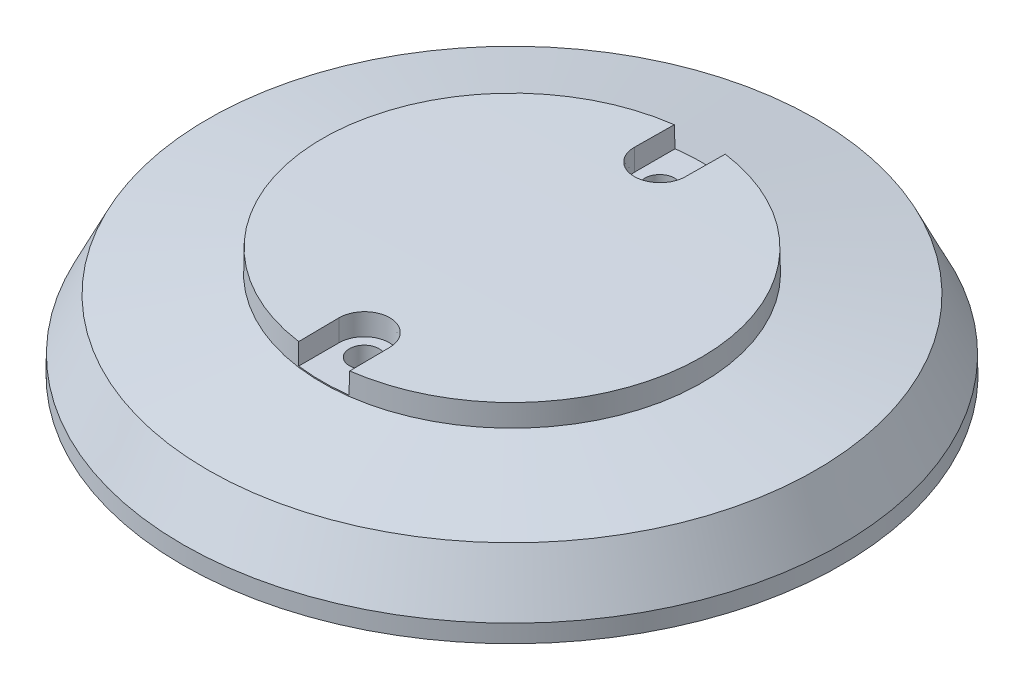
ISO-10303-21;
HEADER;
FILE_DESCRIPTION(('STEP AP214'),'2;1');
FILE_NAME('part.step','',(''),(''),'','','');
FILE_SCHEMA(('AUTOMOTIVE_DESIGN { 1 0 10303 214 1 1 1 1 }'));
ENDSEC;
DATA;
#1=APPLICATION_CONTEXT('core data for automotive mechanical design processes');
#2=APPLICATION_PROTOCOL_DEFINITION('international standard','automotive_design',2000,#1);
#3=PRODUCT_CONTEXT('',#1,'mechanical');
#4=PRODUCT('Part','Part','',(#3));
#5=PRODUCT_RELATED_PRODUCT_CATEGORY('part','',(#4));
#6=PRODUCT_DEFINITION_FORMATION('','',#4);
#7=PRODUCT_DEFINITION_CONTEXT('part definition',#1,'design');
#8=PRODUCT_DEFINITION('design','',#6,#7);
#9=PRODUCT_DEFINITION_SHAPE('','',#8);
#10=(LENGTH_UNIT() NAMED_UNIT(*) SI_UNIT(.MILLI.,.METRE.));
#11=(NAMED_UNIT(*) PLANE_ANGLE_UNIT() SI_UNIT($,.RADIAN.));
#12=(NAMED_UNIT(*) SI_UNIT($,.STERADIAN.) SOLID_ANGLE_UNIT());
#13=UNCERTAINTY_MEASURE_WITH_UNIT(LENGTH_MEASURE(1.E-05),#10,'distance_accuracy_value','');
#14=(GEOMETRIC_REPRESENTATION_CONTEXT(3) GLOBAL_UNCERTAINTY_ASSIGNED_CONTEXT((#13)) GLOBAL_UNIT_ASSIGNED_CONTEXT((#10,
#11,#12)) REPRESENTATION_CONTEXT('',''));
#15=CARTESIAN_POINT('',(0.,0.,0.));
#16=DIRECTION('',(0.,0.,1.));
#17=DIRECTION('',(1.,0.,0.));
#18=AXIS2_PLACEMENT_3D('',#15,#16,#17);
#19=CARTESIAN_POINT('',(0.,11.0489999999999,0.));
#20=DIRECTION('',(0.,-1.,0.));
#21=DIRECTION('',(0.,0.,-1.));
#22=AXIS2_PLACEMENT_3D('',#19,#20,#21);
#23=CONICAL_SURFACE('',#22,18.3797766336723,0.0174532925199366);
#24=CARTESIAN_POINT('',(-1.1459821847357,10.32149,-18.3567392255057));
#25=CARTESIAN_POINT('',(-1.13403179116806,9.7502145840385,-18.3674761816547));
#26=CARTESIAN_POINT('',(-1.1217388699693,9.17894639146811,-18.3782217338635));
#27=CARTESIAN_POINT('',(-1.09638391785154,8.03642874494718,-18.3997299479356));
#28=CARTESIAN_POINT('',(-1.08332188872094,7.46517929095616,-18.4104926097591));
#29=CARTESIAN_POINT('',(-1.05606071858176,6.31067798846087,-18.4322617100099));
#30=CARTESIAN_POINT('',(-1.04184343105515,5.72742657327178,-18.4432685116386));
#31=CARTESIAN_POINT('',(-1.01239495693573,4.56094832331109,-18.4652998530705));
#32=CARTESIAN_POINT('',(-0.997163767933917,3.97772148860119,-18.4763243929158));
#33=CARTESIAN_POINT('',(-0.981363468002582,3.39450999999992,-18.4873577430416));
#34=B_SPLINE_CURVE_WITH_KNOTS('',3,(#24,#25,#26,#27,#28,#29,#30,#31,#32,#33),.UNSPECIFIED.,.F.,
.F.,(4,2,2,2,4),(0.,1.71450383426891,3.429003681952,5.17958829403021,6.93017706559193),.UNSPECIFIED.);
#35=CARTESIAN_POINT('',(-1.08088361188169,7.36599999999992,-18.4123647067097));
#36=VERTEX_POINT('',#35);
#37=CARTESIAN_POINT('',(-0.982297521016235,3.42899999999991,-18.4867052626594));
#38=VERTEX_POINT('',#37);
#39=EDGE_CURVE('E178',#36,#38,#34,.T.);
#40=ORIENTED_EDGE('',*,*,#39,.F.);
#41=CARTESIAN_POINT('',(0.,7.36599999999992,0.));
#42=DIRECTION('',(0.,-1.,0.));
#43=DIRECTION('',(0.,0.,-1.));
#44=AXIS2_PLACEMENT_3D('',#41,#42,#43);
#45=CIRCLE('',#44,18.4440636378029);
#46=CARTESIAN_POINT('',(-4.44421299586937,7.36599999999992,-17.9006272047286));
#47=VERTEX_POINT('',#46);
#48=EDGE_CURVE('E189',#47,#36,#45,.T.);
#49=ORIENTED_EDGE('',*,*,#48,.F.);
#50=CARTESIAN_POINT('',(-4.44420950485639,7.36579999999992,-17.9006316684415));
#51=CARTESIAN_POINT('',(-4.45492518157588,7.97970070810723,-17.8869303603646));
#52=CARTESIAN_POINT('',(-4.46564085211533,8.59360106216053,-17.8732132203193));
#53=CARTESIAN_POINT('',(-4.4870721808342,9.82140106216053,-17.8457472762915));
#54=CARTESIAN_POINT('',(-4.49778783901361,10.4353007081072,-17.8319984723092));
#55=CARTESIAN_POINT('',(-4.50850349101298,11.0491999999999,-17.8182338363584));
#56=B_SPLINE_CURVE_WITH_KNOTS('',3,(#50,#51,#52,#53,#54,#55),.UNSPECIFIED.,.F.,.F.,(4,2,4),(0.,
1.84244122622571,3.68488245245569),.UNSPECIFIED.);
#57=CARTESIAN_POINT('',(-4.5085,11.0489999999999,-17.818238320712));
#58=VERTEX_POINT('',#57);
#59=EDGE_CURVE('E310',#47,#58,#56,.T.);
#60=ORIENTED_EDGE('',*,*,#59,.T.);
#61=CARTESIAN_POINT('',(0.,11.0489999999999,0.));
#62=DIRECTION('',(0.,-1.,0.));
#63=DIRECTION('',(0.,0.,-1.));
#64=AXIS2_PLACEMENT_3D('',#61,#62,#63);
#65=CIRCLE('',#64,18.3797766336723);
#66=CARTESIAN_POINT('',(-4.5085,11.0489999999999,17.818238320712));
#67=VERTEX_POINT('',#66);
#68=EDGE_CURVE('E439',#67,#58,#65,.T.);
#69=ORIENTED_EDGE('',*,*,#68,.F.);
#70=CARTESIAN_POINT('',(-4.44420950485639,7.36579999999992,17.9006316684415));
#71=CARTESIAN_POINT('',(-4.45492518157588,7.97970070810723,17.8869303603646));
#72=CARTESIAN_POINT('',(-4.46564085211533,8.59360106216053,17.8732132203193));
#73=CARTESIAN_POINT('',(-4.4870721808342,9.82140106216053,17.8457472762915));
#74=CARTESIAN_POINT('',(-4.49778783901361,10.4353007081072,17.8319984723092));
#75=CARTESIAN_POINT('',(-4.50850349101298,11.0491999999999,17.8182338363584));
#76=B_SPLINE_CURVE_WITH_KNOTS('',3,(#70,#71,#72,#73,#74,#75),.UNSPECIFIED.,.F.,.F.,(4,2,4),(0.,
1.84244122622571,3.68488245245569),.UNSPECIFIED.);
#77=CARTESIAN_POINT('',(-4.44421299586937,7.36599999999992,17.9006272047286));
#78=VERTEX_POINT('',#77);
#79=EDGE_CURVE('E317',#78,#67,#76,.T.);
#80=ORIENTED_EDGE('',*,*,#79,.F.);
#81=CARTESIAN_POINT('',(0.,7.36599999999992,0.));
#82=DIRECTION('',(0.,-1.,0.));
#83=DIRECTION('',(0.,0.,-1.));
#84=AXIS2_PLACEMENT_3D('',#81,#82,#83);
#85=CIRCLE('',#84,18.4440636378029);
#86=CARTESIAN_POINT('',(-1.08088361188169,7.36599999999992,18.4123647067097));
#87=VERTEX_POINT('',#86);
#88=EDGE_CURVE('E202',#87,#78,#85,.T.);
#89=ORIENTED_EDGE('',*,*,#88,.F.);
#90=CARTESIAN_POINT('',(-0.981363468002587,3.39450999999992,18.4873577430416));
#91=CARTESIAN_POINT('',(-0.996838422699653,3.96570022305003,18.4765518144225));
#92=CARTESIAN_POINT('',(-1.01176704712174,4.53690518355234,18.4657543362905));
#93=CARTESIAN_POINT('',(-1.04064922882,5.67933877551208,18.4441763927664));
#94=CARTESIAN_POINT('',(-1.05460278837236,6.25056740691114,18.4333959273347));
#95=CARTESIAN_POINT('',(-1.0819371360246,7.40506694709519,18.4116253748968));
#96=CARTESIAN_POINT('',(-1.09529969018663,7.98833829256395,18.4006356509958));
#97=CARTESIAN_POINT('',(-1.12122114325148,9.154900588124,18.3786740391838));
#98=CARTESIAN_POINT('',(-1.13378004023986,9.73819153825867,18.3677021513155));
#99=CARTESIAN_POINT('',(-1.1459821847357,10.32149,18.3567392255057));
#100=B_SPLINE_CURVE_WITH_KNOTS('',3,(#90,#91,#92,#93,#94,#95,#96,#97,#98,#99),.UNSPECIFIED.,.F.,
.F.,(4,2,2,2,4),(0.,1.71450535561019,3.42900670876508,5.17958980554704,6.93017707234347),.UNSPECIFIED.);
#101=CARTESIAN_POINT('',(-0.982297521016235,3.42899999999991,18.4867052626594));
#102=VERTEX_POINT('',#101);
#103=EDGE_CURVE('E64',#102,#87,#100,.T.);
#104=ORIENTED_EDGE('',*,*,#103,.F.);
#105=CARTESIAN_POINT('',(0.,3.42899999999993,0.));
#106=DIRECTION('',(0.,-1.,0.));
#107=DIRECTION('',(0.,0.,-1.));
#108=AXIS2_PLACEMENT_3D('',#105,#106,#107);
#109=CIRCLE('',#108,18.5127842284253);
#110=EDGE_CURVE('E191',#102,#38,#109,.T.);
#111=ORIENTED_EDGE('',*,*,#110,.T.);
#112=EDGE_LOOP('',(#40,#49,#60,#69,#80,#89,#104,#111));
#113=FACE_BOUND('',#112,.T.);
#114=ADVANCED_FACE('F36',(#113),#23,.F.);
#115=CARTESIAN_POINT('',(0.981363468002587,3.39450999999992,-18.4873577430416));
#116=CARTESIAN_POINT('',(0.996838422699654,3.96570022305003,-18.4765518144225));
#117=CARTESIAN_POINT('',(1.01176704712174,4.53690518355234,-18.4657543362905));
#118=CARTESIAN_POINT('',(1.04064922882,5.67933877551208,-18.4441763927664));
#119=CARTESIAN_POINT('',(1.05460278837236,6.25056740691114,-18.4333959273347));
#120=CARTESIAN_POINT('',(1.0819371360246,7.40506694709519,-18.4116253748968));
#121=CARTESIAN_POINT('',(1.09529969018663,7.98833829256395,-18.4006356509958));
#122=CARTESIAN_POINT('',(1.12122114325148,9.154900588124,-18.3786740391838));
#123=CARTESIAN_POINT('',(1.13378004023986,9.73819153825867,-18.3677021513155));
#124=CARTESIAN_POINT('',(1.1459821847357,10.32149,-18.3567392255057));
#125=B_SPLINE_CURVE_WITH_KNOTS('',3,(#115,#116,#117,#118,#119,#120,#121,#122,#123,#124),
.UNSPECIFIED.,.F.,.F.,(4,2,2,2,4),(0.,1.71450535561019,3.42900670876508,5.17958980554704,
6.93017707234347),.UNSPECIFIED.);
#126=CARTESIAN_POINT('',(0.982297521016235,3.42899999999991,-18.4867052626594));
#127=VERTEX_POINT('',#126);
#128=CARTESIAN_POINT('',(1.08088361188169,7.36599999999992,-18.4123647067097));
#129=VERTEX_POINT('',#128);
#130=EDGE_CURVE('E56',#127,#129,#125,.T.);
#131=ORIENTED_EDGE('',*,*,#130,.F.);
#132=CARTESIAN_POINT('',(0.982297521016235,3.42899999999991,18.4867052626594));
#133=VERTEX_POINT('',#132);
#134=EDGE_CURVE('E514',#127,#133,#109,.T.);
#135=ORIENTED_EDGE('',*,*,#134,.T.);
#136=CARTESIAN_POINT('',(1.1459821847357,10.32149,18.3567392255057));
#137=CARTESIAN_POINT('',(1.13403179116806,9.7502145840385,18.3674761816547));
#138=CARTESIAN_POINT('',(1.1217388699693,9.17894639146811,18.3782217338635));
#139=CARTESIAN_POINT('',(1.09638391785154,8.03642874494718,18.3997299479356));
#140=CARTESIAN_POINT('',(1.08332188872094,7.46517929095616,18.4104926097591));
#141=CARTESIAN_POINT('',(1.05606071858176,6.31067798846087,18.4322617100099));
#142=CARTESIAN_POINT('',(1.04184343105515,5.72742657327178,18.4432685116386));
#143=CARTESIAN_POINT('',(1.01239495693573,4.56094832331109,18.4652998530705));
#144=CARTESIAN_POINT('',(0.997163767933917,3.97772148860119,18.4763243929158));
#145=CARTESIAN_POINT('',(0.981363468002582,3.39450999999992,18.4873577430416));
#146=B_SPLINE_CURVE_WITH_KNOTS('',3,(#136,#137,#138,#139,#140,#141,#142,#143,#144,#145),
.UNSPECIFIED.,.F.,.F.,(4,2,2,2,4),(0.,1.71450383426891,3.429003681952,5.17958829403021,
6.93017706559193),.UNSPECIFIED.);
#147=CARTESIAN_POINT('',(1.08088361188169,7.36599999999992,18.4123647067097));
#148=VERTEX_POINT('',#147);
#149=EDGE_CURVE('E339',#148,#133,#146,.T.);
#150=ORIENTED_EDGE('',*,*,#149,.F.);
#151=CARTESIAN_POINT('',(4.44421299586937,7.36599999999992,17.9006272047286));
#152=VERTEX_POINT('',#151);
#153=EDGE_CURVE('E208',#152,#148,#85,.T.);
#154=ORIENTED_EDGE('',*,*,#153,.F.);
#155=CARTESIAN_POINT('',(4.50850349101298,11.0491999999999,17.8182338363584));
#156=CARTESIAN_POINT('',(4.49778783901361,10.4353007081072,17.8319984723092));
#157=CARTESIAN_POINT('',(4.4870721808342,9.82140106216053,17.8457472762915));
#158=CARTESIAN_POINT('',(4.46564085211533,8.59360106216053,17.8732132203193));
#159=CARTESIAN_POINT('',(4.45492518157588,7.97970070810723,17.8869303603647));
#160=CARTESIAN_POINT('',(4.44420950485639,7.36579999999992,17.9006316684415));
#161=B_SPLINE_CURVE_WITH_KNOTS('',3,(#155,#156,#157,#158,#159,#160),.UNSPECIFIED.,.F.,.F.,(4,2,
4),(0.,1.84244122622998,3.68488245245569),.UNSPECIFIED.);
#162=CARTESIAN_POINT('',(4.5085,11.0489999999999,17.818238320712));
#163=VERTEX_POINT('',#162);
#164=EDGE_CURVE('E325',#163,#152,#161,.T.);
#165=ORIENTED_EDGE('',*,*,#164,.F.);
#166=CARTESIAN_POINT('',(4.5085,11.0489999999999,-17.818238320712));
#167=VERTEX_POINT('',#166);
#168=EDGE_CURVE('E470',#167,#163,#65,.T.);
#169=ORIENTED_EDGE('',*,*,#168,.F.);
#170=CARTESIAN_POINT('',(4.50850349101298,11.0491999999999,-17.8182338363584));
#171=CARTESIAN_POINT('',(4.49778783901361,10.4353007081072,-17.8319984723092));
#172=CARTESIAN_POINT('',(4.4870721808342,9.82140106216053,-17.8457472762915));
#173=CARTESIAN_POINT('',(4.46564085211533,8.59360106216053,-17.8732132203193));
#174=CARTESIAN_POINT('',(4.45492518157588,7.97970070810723,-17.8869303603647));
#175=CARTESIAN_POINT('',(4.44420950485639,7.36579999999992,-17.9006316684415));
#176=B_SPLINE_CURVE_WITH_KNOTS('',3,(#170,#171,#172,#173,#174,#175),.UNSPECIFIED.,.F.,.F.,(4,2,
4),(0.,1.84244122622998,3.68488245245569),.UNSPECIFIED.);
#177=CARTESIAN_POINT('',(4.44421299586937,7.36599999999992,-17.9006272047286));
#178=VERTEX_POINT('',#177);
#179=EDGE_CURVE('E301',#167,#178,#176,.T.);
#180=ORIENTED_EDGE('',*,*,#179,.T.);
#181=EDGE_CURVE('E199',#129,#178,#45,.T.);
#182=ORIENTED_EDGE('',*,*,#181,.F.);
#183=EDGE_LOOP('',(#131,#135,#150,#154,#165,#169,#180,#182));
#184=FACE_BOUND('',#183,.T.);
#185=ADVANCED_FACE('F285',(#184),#23,.F.);
#186=CARTESIAN_POINT('',(18.3797766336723,11.0489999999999,0.));
#187=DIRECTION('',(0.,-1.,0.));
#188=DIRECTION('',(0.,0.,-1.));
#189=AXIS2_PLACEMENT_3D('',#186,#187,#188);
#190=PLANE('',#189);
#191=DIRECTION('',(0.,0.,1.));
#192=VECTOR('',#191,1.);
#193=CARTESIAN_POINT('',(4.5085,11.0489999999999,0.));
#194=LINE('',#193,#192);
#195=CARTESIAN_POINT('',(4.5085,11.0489999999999,17.0815));
#196=VERTEX_POINT('',#195);
#197=EDGE_CURVE('E198',#196,#163,#194,.T.);
#198=ORIENTED_EDGE('',*,*,#197,.F.);
#199=CARTESIAN_POINT('',(0.,11.0489999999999,17.0815));
#200=DIRECTION('',(0.,1.,0.));
#201=DIRECTION('',(0.,0.,1.));
#202=AXIS2_PLACEMENT_3D('',#199,#200,#201);
#203=CIRCLE('',#202,4.5085);
#204=CARTESIAN_POINT('',(-4.5085,11.0489999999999,17.0815));
#205=VERTEX_POINT('',#204);
#206=EDGE_CURVE('E411',#196,#205,#203,.T.);
#207=ORIENTED_EDGE('',*,*,#206,.T.);
#208=DIRECTION('',(0.,0.,1.));
#209=VECTOR('',#208,1.);
#210=CARTESIAN_POINT('',(-4.5085,11.0489999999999,17.0815));
#211=LINE('',#210,#209);
#212=EDGE_CURVE('E413',#205,#67,#211,.T.);
#213=ORIENTED_EDGE('',*,*,#212,.T.);
#214=ORIENTED_EDGE('',*,*,#68,.T.);
#215=DIRECTION('',(0.,0.,-1.));
#216=VECTOR('',#215,1.);
#217=CARTESIAN_POINT('',(-4.5085,11.0489999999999,-17.0815));
#218=LINE('',#217,#216);
#219=CARTESIAN_POINT('',(-4.5085,11.0489999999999,-17.0815));
#220=VERTEX_POINT('',#219);
#221=EDGE_CURVE('E444',#220,#58,#218,.T.);
#222=ORIENTED_EDGE('',*,*,#221,.F.);
#223=CARTESIAN_POINT('',(0.,11.0489999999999,-17.0815));
#224=DIRECTION('',(0.,-1.,0.));
#225=DIRECTION('',(0.,0.,-1.));
#226=AXIS2_PLACEMENT_3D('',#223,#224,#225);
#227=CIRCLE('',#226,4.5085);
#228=CARTESIAN_POINT('',(4.5085,11.0489999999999,-17.0815));
#229=VERTEX_POINT('',#228);
#230=EDGE_CURVE('E441',#229,#220,#227,.T.);
#231=ORIENTED_EDGE('',*,*,#230,.F.);
#232=DIRECTION('',(0.,0.,1.));
#233=VECTOR('',#232,1.);
#234=CARTESIAN_POINT('',(4.5085,11.0489999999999,0.));
#235=LINE('',#234,#233);
#236=EDGE_CURVE('E204',#229,#167,#235,.F.);
#237=ORIENTED_EDGE('',*,*,#236,.T.);
#238=ORIENTED_EDGE('',*,*,#168,.T.);
#239=EDGE_LOOP('',(#198,#207,#213,#214,#222,#231,#237,#238));
#240=FACE_BOUND('',#239,.T.);
#241=ADVANCED_FACE('F290',(#240),#190,.T.);
#242=CARTESIAN_POINT('',(0.,-1876.75837499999,0.));
#243=DIRECTION('',(0.,-1.,0.));
#244=DIRECTION('',(1.,0.,0.));
#245=AXIS2_PLACEMENT_3D('',#242,#243,#244);
#246=SPHERICAL_SURFACE('',#245,1889.58537499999);
#247=CARTESIAN_POINT('',(30.0250705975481,-1876.23428544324,0.));
#248=DIRECTION('',(-0.999847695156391,-0.0174524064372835,0.));
#249=DIRECTION('',(0.0174524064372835,-0.999847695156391,0.));
#250=AXIS2_PLACEMENT_3D('',#247,#248,#249);
#251=CIRCLE('',#250,1889.34674156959);
#252=CARTESIAN_POINT('',(-2.9464,12.7,-21.7084610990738));
#253=VERTEX_POINT('',#252);
#254=CARTESIAN_POINT('',(-2.94722899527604,12.7474931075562,-17.0815));
#255=VERTEX_POINT('',#254);
#256=EDGE_CURVE('E380',#253,#255,#251,.F.);
#257=ORIENTED_EDGE('',*,*,#256,.F.);
#258=CARTESIAN_POINT('',(0.,12.7,0.));
#259=DIRECTION('',(0.,-1.,0.));
#260=DIRECTION('',(0.,0.,-1.));
#261=AXIS2_PLACEMENT_3D('',#258,#259,#260);
#262=CIRCLE('',#261,21.9075);
#263=CARTESIAN_POINT('',(-2.9464,12.7,21.7084610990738));
#264=VERTEX_POINT('',#263);
#265=EDGE_CURVE('E474',#264,#253,#262,.T.);
#266=ORIENTED_EDGE('',*,*,#265,.F.);
#267=CARTESIAN_POINT('',(30.0250705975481,-1876.23428544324,0.));
#268=DIRECTION('',(-0.999847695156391,-0.0174524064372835,0.));
#269=DIRECTION('',(0.0174524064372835,-0.999847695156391,0.));
#270=AXIS2_PLACEMENT_3D('',#267,#268,#269);
#271=CIRCLE('',#270,1889.34674156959);
#272=CARTESIAN_POINT('',(-2.94722899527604,12.7474931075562,17.0815));
#273=VERTEX_POINT('',#272);
#274=EDGE_CURVE('E409',#273,#264,#271,.F.);
#275=ORIENTED_EDGE('',*,*,#274,.F.);
#276=CARTESIAN_POINT('',(2.94722895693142,12.7474912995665,17.0817));
#277=CARTESIAN_POINT('',(2.94725560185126,12.7482406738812,16.9988041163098));
#278=CARTESIAN_POINT('',(2.9437690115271,12.7489900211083,16.9159112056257));
#279=CARTESIAN_POINT('',(2.9298306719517,12.7504833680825,16.7507168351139));
#280=CARTESIAN_POINT('',(2.91937925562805,12.7512273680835,16.6684153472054));
#281=CARTESIAN_POINT('',(2.8915823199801,12.7527042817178,16.5050386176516));
#282=CARTESIAN_POINT('',(2.87424164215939,12.7534372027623,16.4239625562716));
#283=CARTESIAN_POINT('',(2.83280686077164,12.754887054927,16.2635791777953));
#284=CARTESIAN_POINT('',(2.80871283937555,12.7556039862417,16.1842718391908));
#285=CARTESIAN_POINT('',(2.72649614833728,12.7577238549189,15.9497706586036));
#286=CARTESIAN_POINT('',(2.65842702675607,12.7590964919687,15.7979285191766));
#287=CARTESIAN_POINT('',(2.49780811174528,12.7617179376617,15.507941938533));
#288=CARTESIAN_POINT('',(2.40526313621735,12.7629667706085,15.3697948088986));
#289=CARTESIAN_POINT('',(2.19828478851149,12.7653064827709,15.1109733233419));
#290=CARTESIAN_POINT('',(2.08385133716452,12.7663973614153,14.9902990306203));
#291=CARTESIAN_POINT('',(1.83633236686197,12.7683900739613,14.7698626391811));
#292=CARTESIAN_POINT('',(1.70324401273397,12.7692918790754,14.6701037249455));
#293=CARTESIAN_POINT('',(1.4222168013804,12.7708806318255,14.4943536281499));
#294=CARTESIAN_POINT('',(1.27427917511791,12.7715675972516,14.4183604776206));
#295=CARTESIAN_POINT('',(0.967754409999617,12.772707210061,14.2922947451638));
#296=CARTESIAN_POINT('',(0.809167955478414,12.7731598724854,14.2422204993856));
#297=CARTESIAN_POINT('',(0.485841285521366,12.7738180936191,14.1694070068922));
#298=CARTESIAN_POINT('',(0.321101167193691,12.7740236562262,14.1466673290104));
#299=CARTESIAN_POINT('',(-0.00986243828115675,12.7741818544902,14.1291671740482));
#300=CARTESIAN_POINT('',(-0.17608595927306,12.7741344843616,14.1344073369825));
#301=CARTESIAN_POINT('',(-0.50528914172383,12.7737881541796,14.1727189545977));
#302=CARTESIAN_POINT('',(-0.668268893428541,12.7734892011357,14.2057896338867));
#303=CARTESIAN_POINT('',(-0.986362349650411,12.7726482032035,14.2988221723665));
#304=CARTESIAN_POINT('',(-1.14147607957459,12.7721061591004,14.3587839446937));
#305=CARTESIAN_POINT('',(-1.43944023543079,12.7707943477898,14.5038984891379));
#306=CARTESIAN_POINT('',(-1.58229024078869,12.7700245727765,14.5890521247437));
#307=CARTESIAN_POINT('',(-1.85165957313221,12.7682791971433,14.7821279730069));
#308=CARTESIAN_POINT('',(-1.97817969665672,12.7673036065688,14.890049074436));
#309=CARTESIAN_POINT('',(-2.21129460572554,12.7651744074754,15.1255836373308));
#310=CARTESIAN_POINT('',(-2.31789144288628,12.7640208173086,15.2531950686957));
#311=CARTESIAN_POINT('',(-2.50818219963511,12.7615677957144,15.5245507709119));
#312=CARTESIAN_POINT('',(-2.59186885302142,12.7602683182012,15.6683001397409));
#313=CARTESIAN_POINT('',(-2.73396315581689,12.757560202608,15.9678739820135));
#314=CARTESIAN_POINT('',(-2.79235444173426,12.7561514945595,16.1237061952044));
#315=CARTESIAN_POINT('',(-2.88205665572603,12.7532665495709,16.4428403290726));
#316=CARTESIAN_POINT('',(-2.91340881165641,12.7517904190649,16.6061304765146));
#317=CARTESIAN_POINT('',(-2.93631946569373,12.7498356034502,16.8223727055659));
#318=CARTESIAN_POINT('',(-2.94042294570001,12.7493670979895,16.8741988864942));
#319=CARTESIAN_POINT('',(-2.94587979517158,12.7484295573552,16.9779098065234));
#320=CARTESIAN_POINT('',(-2.94723770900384,12.7479605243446,17.0297943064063));
#321=CARTESIAN_POINT('',(-2.94722895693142,12.7474912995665,17.0817));
#322=B_SPLINE_CURVE_WITH_KNOTS('',3,(#276,#277,#278,#279,#280,#281,#282,#283,#284,#285,#286,
#287,#288,#289,#290,#291,#292,#293,#294,#295,#296,#297,#298,#299,#300,#301,#302,#303,#304,#305,
#306,#307,#308,#309,#310,#311,#312,#313,#314,#315,#316,#317,#318,#319,#320,#321),.UNSPECIFIED.,
.F.,.F.,(4,2,2,2,2,2,2,2,2,2,2,2,2,2,2,2,2,2,2,2,2,2,4),(0.,0.248616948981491,0.497222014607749,
0.745652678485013,0.994080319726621,1.49072783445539,1.9872776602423,2.4838292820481,
2.98045645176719,3.47704248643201,3.97359663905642,4.47014295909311,4.96670063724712,
5.46324448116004,5.95978672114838,6.45634598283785,6.95288101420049,7.44936488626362,
7.9460060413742,8.44296799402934,8.93917085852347,9.09509152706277,9.25075390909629),.UNSPECIFIED.);
#323=CARTESIAN_POINT('',(2.94722899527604,12.7474931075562,17.0815));
#324=VERTEX_POINT('',#323);
#325=EDGE_CURVE('E246',#324,#273,#322,.T.);
#326=ORIENTED_EDGE('',*,*,#325,.F.);
#327=CARTESIAN_POINT('',(-30.0250705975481,-1876.23428544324,0.));
#328=DIRECTION('',(0.999847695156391,-0.0174524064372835,0.));
#329=DIRECTION('',(0.0174524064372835,0.999847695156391,0.));
#330=AXIS2_PLACEMENT_3D('',#327,#328,#329);
#331=CIRCLE('',#330,1889.34674156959);
#332=CARTESIAN_POINT('',(2.9464,12.7,21.7084610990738));
#333=VERTEX_POINT('',#332);
#334=EDGE_CURVE('E403',#333,#324,#331,.F.);
#335=ORIENTED_EDGE('',*,*,#334,.F.);
#336=CARTESIAN_POINT('',(2.9464,12.7,-21.7084610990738));
#337=VERTEX_POINT('',#336);
#338=EDGE_CURVE('E476',#337,#333,#262,.T.);
#339=ORIENTED_EDGE('',*,*,#338,.F.);
#340=CARTESIAN_POINT('',(-30.0250705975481,-1876.23428544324,0.));
#341=DIRECTION('',(0.999847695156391,-0.0174524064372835,0.));
#342=DIRECTION('',(0.0174524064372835,0.999847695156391,0.));
#343=AXIS2_PLACEMENT_3D('',#340,#341,#342);
#344=CIRCLE('',#343,1889.34674156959);
#345=CARTESIAN_POINT('',(2.94722899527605,12.7474931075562,-17.0815));
#346=VERTEX_POINT('',#345);
#347=EDGE_CURVE('E391',#346,#337,#344,.F.);
#348=ORIENTED_EDGE('',*,*,#347,.F.);
#349=CARTESIAN_POINT('',(-2.94722895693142,12.7474912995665,-17.0817));
#350=CARTESIAN_POINT('',(-2.94725560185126,12.7482406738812,-16.9988041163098));
#351=CARTESIAN_POINT('',(-2.9437690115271,12.7489900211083,-16.9159112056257));
#352=CARTESIAN_POINT('',(-2.9298306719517,12.7504833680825,-16.7507168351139));
#353=CARTESIAN_POINT('',(-2.91937925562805,12.7512273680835,-16.6684153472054));
#354=CARTESIAN_POINT('',(-2.8915823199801,12.7527042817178,-16.5050386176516));
#355=CARTESIAN_POINT('',(-2.87424164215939,12.7534372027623,-16.4239625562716));
#356=CARTESIAN_POINT('',(-2.83280686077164,12.754887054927,-16.2635791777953));
#357=CARTESIAN_POINT('',(-2.80871283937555,12.7556039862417,-16.1842718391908));
#358=CARTESIAN_POINT('',(-2.72649614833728,12.7577238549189,-15.9497706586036));
#359=CARTESIAN_POINT('',(-2.65842702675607,12.7590964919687,-15.7979285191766));
#360=CARTESIAN_POINT('',(-2.49780811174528,12.7617179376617,-15.507941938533));
#361=CARTESIAN_POINT('',(-2.40526313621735,12.7629667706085,-15.3697948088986));
#362=CARTESIAN_POINT('',(-2.19828478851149,12.7653064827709,-15.1109733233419));
#363=CARTESIAN_POINT('',(-2.08385133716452,12.7663973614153,-14.9902990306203));
#364=CARTESIAN_POINT('',(-1.83633236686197,12.7683900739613,-14.7698626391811));
#365=CARTESIAN_POINT('',(-1.70324401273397,12.7692918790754,-14.6701037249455));
#366=CARTESIAN_POINT('',(-1.4222168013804,12.7708806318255,-14.4943536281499));
#367=CARTESIAN_POINT('',(-1.27427917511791,12.7715675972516,-14.4183604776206));
#368=CARTESIAN_POINT('',(-0.967754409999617,12.772707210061,-14.2922947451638));
#369=CARTESIAN_POINT('',(-0.809167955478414,12.7731598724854,-14.2422204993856));
#370=CARTESIAN_POINT('',(-0.485841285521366,12.7738180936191,-14.1694070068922));
#371=CARTESIAN_POINT('',(-0.321101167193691,12.7740236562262,-14.1466673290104));
#372=CARTESIAN_POINT('',(0.00986243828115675,12.7741818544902,-14.1291671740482));
#373=CARTESIAN_POINT('',(0.17608595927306,12.7741344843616,-14.1344073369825));
#374=CARTESIAN_POINT('',(0.50528914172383,12.7737881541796,-14.1727189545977));
#375=CARTESIAN_POINT('',(0.668268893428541,12.7734892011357,-14.2057896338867));
#376=CARTESIAN_POINT('',(0.986362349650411,12.7726482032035,-14.2988221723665));
#377=CARTESIAN_POINT('',(1.14147607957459,12.7721061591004,-14.3587839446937));
#378=CARTESIAN_POINT('',(1.43944023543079,12.7707943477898,-14.5038984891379));
#379=CARTESIAN_POINT('',(1.58229024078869,12.7700245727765,-14.5890521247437));
#380=CARTESIAN_POINT('',(1.85165957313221,12.7682791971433,-14.7821279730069));
#381=CARTESIAN_POINT('',(1.97817969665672,12.7673036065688,-14.890049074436));
#382=CARTESIAN_POINT('',(2.21129460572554,12.7651744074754,-15.1255836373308));
#383=CARTESIAN_POINT('',(2.31789144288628,12.7640208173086,-15.2531950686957));
#384=CARTESIAN_POINT('',(2.50818219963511,12.7615677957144,-15.5245507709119));
#385=CARTESIAN_POINT('',(2.59186885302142,12.7602683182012,-15.6683001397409));
#386=CARTESIAN_POINT('',(2.73396315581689,12.757560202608,-15.9678739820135));
#387=CARTESIAN_POINT('',(2.79235444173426,12.7561514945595,-16.1237061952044));
#388=CARTESIAN_POINT('',(2.88205665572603,12.7532665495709,-16.4428403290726));
#389=CARTESIAN_POINT('',(2.91340881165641,12.7517904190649,-16.6061304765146));
#390=CARTESIAN_POINT('',(2.93631946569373,12.7498356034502,-16.8223727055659));
#391=CARTESIAN_POINT('',(2.94042294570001,12.7493670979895,-16.8741988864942));
#392=CARTESIAN_POINT('',(2.94587979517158,12.7484295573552,-16.9779098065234));
#393=CARTESIAN_POINT('',(2.94723770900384,12.7479605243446,-17.0297943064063));
#394=CARTESIAN_POINT('',(2.94722895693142,12.7474912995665,-17.0817));
#395=B_SPLINE_CURVE_WITH_KNOTS('',3,(#349,#350,#351,#352,#353,#354,#355,#356,#357,#358,#359,
#360,#361,#362,#363,#364,#365,#366,#367,#368,#369,#370,#371,#372,#373,#374,#375,#376,#377,#378,
#379,#380,#381,#382,#383,#384,#385,#386,#387,#388,#389,#390,#391,#392,#393,#394),.UNSPECIFIED.,
.F.,.F.,(4,2,2,2,2,2,2,2,2,2,2,2,2,2,2,2,2,2,2,2,2,2,4),(0.,0.248616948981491,0.497222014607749,
0.745652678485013,0.994080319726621,1.49072783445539,1.9872776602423,2.4838292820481,
2.98045645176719,3.47704248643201,3.97359663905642,4.47014295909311,4.96670063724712,
5.46324448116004,5.95978672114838,6.45634598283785,6.95288101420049,7.44936488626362,
7.9460060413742,8.44296799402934,8.93917085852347,9.09509152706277,9.25075390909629),.UNSPECIFIED.);
#396=EDGE_CURVE('E12',#255,#346,#395,.T.);
#397=ORIENTED_EDGE('',*,*,#396,.F.);
#398=EDGE_LOOP('',(#257,#266,#275,#326,#335,#339,#348,#397));
#399=FACE_BOUND('',#398,.T.);
#400=ADVANCED_FACE('F38',(#399),#246,.T.);
#401=CARTESIAN_POINT('',(0.,10.16,0.));
#402=DIRECTION('',(0.,-1.,0.));
#403=DIRECTION('',(0.,0.,-1.));
#404=AXIS2_PLACEMENT_3D('',#401,#402,#403);
#405=CONICAL_SURFACE('',#404,21.9518358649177,0.0174532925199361);
#406=CARTESIAN_POINT('',(-2.90427743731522,10.2868,-21.7566335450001));
#407=CARTESIAN_POINT('',(-2.91129844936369,10.6890335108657,-21.7486130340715));
#408=CARTESIAN_POINT('',(-2.91831945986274,11.0912669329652,-21.7405880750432));
#409=CARTESIAN_POINT('',(-2.93236147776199,11.8957335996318,-21.724529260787));
#410=CARTESIAN_POINT('',(-2.9393824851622,12.297966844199,-21.7164954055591));
#411=CARTESIAN_POINT('',(-2.94640349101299,12.7002,-21.7084571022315));
#412=B_SPLINE_CURVE_WITH_KNOTS('',3,(#406,#407,#408,#409,#410,#411),.UNSPECIFIED.,.F.,.F.,(4,2,
4),(0.,1.20712417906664,2.41424835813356),.UNSPECIFIED.);
#413=CARTESIAN_POINT('',(-2.90428092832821,10.287,-21.7566295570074));
#414=VERTEX_POINT('',#413);
#415=EDGE_CURVE('E49',#414,#253,#412,.T.);
#416=ORIENTED_EDGE('',*,*,#415,.F.);
#417=CARTESIAN_POINT('',(0.,10.287,0.));
#418=DIRECTION('',(0.,1.,0.));
#419=DIRECTION('',(0.,0.,1.));
#420=AXIS2_PLACEMENT_3D('',#417,#418,#419);
#421=CIRCLE('',#420,21.9496190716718);
#422=CARTESIAN_POINT('',(2.90428092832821,10.287,-21.7566295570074));
#423=VERTEX_POINT('',#422);
#424=EDGE_CURVE('E251',#414,#423,#421,.F.);
#425=ORIENTED_EDGE('',*,*,#424,.T.);
#426=CARTESIAN_POINT('',(2.94640349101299,12.7002,-21.7084571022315));
#427=CARTESIAN_POINT('',(2.9393824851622,12.297966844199,-21.7164954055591));
#428=CARTESIAN_POINT('',(2.93236147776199,11.8957335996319,-21.724529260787));
#429=CARTESIAN_POINT('',(2.91831945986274,11.0912669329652,-21.7405880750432));
#430=CARTESIAN_POINT('',(2.91129844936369,10.6890335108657,-21.7486130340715));
#431=CARTESIAN_POINT('',(2.90427743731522,10.2868,-21.7566335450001));
#432=B_SPLINE_CURVE_WITH_KNOTS('',3,(#426,#427,#428,#429,#430,#431),.UNSPECIFIED.,.F.,.F.,(4,2,
4),(0.,1.20712417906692,2.41424835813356),.UNSPECIFIED.);
#433=EDGE_CURVE('E254',#337,#423,#432,.T.);
#434=ORIENTED_EDGE('',*,*,#433,.F.);
#435=ORIENTED_EDGE('',*,*,#338,.T.);
#436=CARTESIAN_POINT('',(2.90427743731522,10.2868,21.7566335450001));
#437=CARTESIAN_POINT('',(2.91129844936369,10.6890335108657,21.7486130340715));
#438=CARTESIAN_POINT('',(2.91831945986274,11.0912669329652,21.7405880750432));
#439=CARTESIAN_POINT('',(2.93236147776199,11.8957335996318,21.724529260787));
#440=CARTESIAN_POINT('',(2.9393824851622,12.297966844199,21.7164954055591));
#441=CARTESIAN_POINT('',(2.94640349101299,12.7002,21.7084571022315));
#442=B_SPLINE_CURVE_WITH_KNOTS('',3,(#436,#437,#438,#439,#440,#441),.UNSPECIFIED.,.F.,.F.,(4,2,
4),(0.,1.20712417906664,2.41424835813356),.UNSPECIFIED.);
#443=CARTESIAN_POINT('',(2.90428092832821,10.287,21.7566295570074));
#444=VERTEX_POINT('',#443);
#445=EDGE_CURVE('E214',#444,#333,#442,.T.);
#446=ORIENTED_EDGE('',*,*,#445,.F.);
#447=CARTESIAN_POINT('',(0.,10.287,0.));
#448=DIRECTION('',(0.,1.,0.));
#449=DIRECTION('',(0.,0.,1.));
#450=AXIS2_PLACEMENT_3D('',#447,#448,#449);
#451=CIRCLE('',#450,21.9496190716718);
#452=CARTESIAN_POINT('',(-2.90428092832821,10.287,21.7566295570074));
#453=VERTEX_POINT('',#452);
#454=EDGE_CURVE('E211',#444,#453,#451,.F.);
#455=ORIENTED_EDGE('',*,*,#454,.T.);
#456=CARTESIAN_POINT('',(-2.94640349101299,12.7002,21.7084571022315));
#457=CARTESIAN_POINT('',(-2.9393824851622,12.297966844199,21.7164954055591));
#458=CARTESIAN_POINT('',(-2.93236147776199,11.8957335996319,21.724529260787));
#459=CARTESIAN_POINT('',(-2.91831945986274,11.0912669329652,21.7405880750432));
#460=CARTESIAN_POINT('',(-2.91129844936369,10.6890335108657,21.7486130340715));
#461=CARTESIAN_POINT('',(-2.90427743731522,10.2868,21.7566335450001));
#462=B_SPLINE_CURVE_WITH_KNOTS('',3,(#456,#457,#458,#459,#460,#461),.UNSPECIFIED.,.F.,.F.,(4,2,
4),(0.,1.20712417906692,2.41424835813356),.UNSPECIFIED.);
#463=EDGE_CURVE('E221',#264,#453,#462,.T.);
#464=ORIENTED_EDGE('',*,*,#463,.F.);
#465=ORIENTED_EDGE('',*,*,#265,.T.);
#466=EDGE_LOOP('',(#416,#425,#434,#435,#446,#455,#464,#465));
#467=FACE_BOUND('',#466,.T.);
#468=CARTESIAN_POINT('',(0.,10.16,0.));
#469=DIRECTION('',(0.,-1.,0.));
#470=DIRECTION('',(0.,0.,-1.));
#471=AXIS2_PLACEMENT_3D('',#468,#469,#470);
#472=CIRCLE('',#471,21.9518358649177);
#473=CARTESIAN_POINT('',(0.,10.16,-21.9518358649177));
#474=VERTEX_POINT('',#473);
#475=EDGE_CURVE('E480',#474,#474,#472,.T.);
#476=ORIENTED_EDGE('',*,*,#475,.F.);
#477=EDGE_LOOP('',(#476));
#478=FACE_BOUND('',#477,.T.);
#479=ADVANCED_FACE('F227',(#467,#478),#405,.T.);
#480=CARTESIAN_POINT('',(0.,8.0264,0.));
#481=DIRECTION('',(0.,-1.,0.));
#482=DIRECTION('',(0.,0.,-1.));
#483=AXIS2_PLACEMENT_3D('',#480,#481,#482);
#484=CONICAL_SURFACE('',#483,35.1536,1.41056700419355);
#485=ORIENTED_EDGE('',*,*,#475,.T.);
#486=EDGE_LOOP('',(#485));
#487=FACE_BOUND('',#486,.T.);
#488=CARTESIAN_POINT('',(0.,8.0264,0.));
#489=DIRECTION('',(0.,-1.,0.));
#490=DIRECTION('',(0.,0.,-1.));
#491=AXIS2_PLACEMENT_3D('',#488,#489,#490);
#492=CIRCLE('',#491,35.1536);
#493=CARTESIAN_POINT('',(0.,8.0264,-35.1536));
#494=VERTEX_POINT('',#493);
#495=EDGE_CURVE('E484',#494,#494,#492,.T.);
#496=ORIENTED_EDGE('',*,*,#495,.F.);
#497=EDGE_LOOP('',(#496));
#498=FACE_BOUND('',#497,.T.);
#499=ADVANCED_FACE('F564',(#487,#498),#484,.T.);
#500=CARTESIAN_POINT('',(0.,2.03169051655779,0.));
#501=DIRECTION('',(0.,-1.,0.));
#502=DIRECTION('',(0.,0.,-1.));
#503=AXIS2_PLACEMENT_3D('',#500,#501,#502);
#504=CONICAL_SURFACE('',#503,38.0645367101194,0.452048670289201);
#505=ORIENTED_EDGE('',*,*,#495,.T.);
#506=EDGE_LOOP('',(#505));
#507=FACE_BOUND('',#506,.T.);
#508=CARTESIAN_POINT('',(0.,2.03169051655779,0.));
#509=DIRECTION('',(0.,-1.,0.));
#510=DIRECTION('',(0.,0.,-1.));
#511=AXIS2_PLACEMENT_3D('',#508,#509,#510);
#512=CIRCLE('',#511,38.0645367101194);
#513=CARTESIAN_POINT('',(0.,2.03169051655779,-38.0645367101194));
#514=VERTEX_POINT('',#513);
#515=EDGE_CURVE('E487',#514,#514,#512,.T.);
#516=ORIENTED_EDGE('',*,*,#515,.F.);
#517=EDGE_LOOP('',(#516));
#518=FACE_BOUND('',#517,.T.);
#519=ADVANCED_FACE('F561',(#507,#518),#504,.T.);
#520=CARTESIAN_POINT('',(0.,0.,0.));
#521=DIRECTION('',(0.,-1.,0.));
#522=DIRECTION('',(0.,0.,-1.));
#523=AXIS2_PLACEMENT_3D('',#520,#521,#522);
#524=CONICAL_SURFACE('',#523,38.1,0.0174532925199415);
#525=ORIENTED_EDGE('',*,*,#515,.T.);
#526=EDGE_LOOP('',(#525));
#527=FACE_BOUND('',#526,.T.);
#528=CARTESIAN_POINT('',(0.,0.,0.));
#529=DIRECTION('',(0.,-1.,0.));
#530=DIRECTION('',(0.,0.,-1.));
#531=AXIS2_PLACEMENT_3D('',#528,#529,#530);
#532=CIRCLE('',#531,38.1);
#533=CARTESIAN_POINT('',(0.,0.,-38.1));
#534=VERTEX_POINT('',#533);
#535=EDGE_CURVE('E490',#534,#534,#532,.T.);
#536=ORIENTED_EDGE('',*,*,#535,.F.);
#537=EDGE_LOOP('',(#536));
#538=FACE_BOUND('',#537,.T.);
#539=ADVANCED_FACE('F557',(#527,#538),#524,.T.);
#540=CARTESIAN_POINT('',(36.195,0.,0.));
#541=DIRECTION('',(0.,-1.,0.));
#542=DIRECTION('',(0.,0.,-1.));
#543=AXIS2_PLACEMENT_3D('',#540,#541,#542);
#544=PLANE('',#543);
#545=ORIENTED_EDGE('',*,*,#535,.T.);
#546=EDGE_LOOP('',(#545));
#547=FACE_BOUND('',#546,.T.);
#548=CARTESIAN_POINT('',(0.,0.,0.));
#549=DIRECTION('',(0.,-1.,0.));
#550=DIRECTION('',(0.,0.,-1.));
#551=AXIS2_PLACEMENT_3D('',#548,#549,#550);
#552=CIRCLE('',#551,36.195);
#553=CARTESIAN_POINT('',(0.,0.,-36.195));
#554=VERTEX_POINT('',#553);
#555=EDGE_CURVE('E493',#554,#554,#552,.T.);
#556=ORIENTED_EDGE('',*,*,#555,.F.);
#557=EDGE_LOOP('',(#556));
#558=FACE_BOUND('',#557,.T.);
#559=ADVANCED_FACE('F553',(#547,#558),#544,.T.);
#560=CARTESIAN_POINT('',(0.,1.27570928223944,0.));
#561=DIRECTION('',(0.,-1.,0.));
#562=DIRECTION('',(0.,0.,-1.));
#563=AXIS2_PLACEMENT_3D('',#560,#561,#562);
#564=CONICAL_SURFACE('',#563,36.172732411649,0.0174532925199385);
#565=ORIENTED_EDGE('',*,*,#555,.T.);
#566=EDGE_LOOP('',(#565));
#567=FACE_BOUND('',#566,.T.);
#568=CARTESIAN_POINT('',(0.,1.27570928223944,0.));
#569=DIRECTION('',(0.,-1.,0.));
#570=DIRECTION('',(0.,0.,-1.));
#571=AXIS2_PLACEMENT_3D('',#568,#569,#570);
#572=CIRCLE('',#571,36.172732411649);
#573=CARTESIAN_POINT('',(0.,1.27570928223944,-36.172732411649));
#574=VERTEX_POINT('',#573);
#575=EDGE_CURVE('E496',#574,#574,#572,.T.);
#576=ORIENTED_EDGE('',*,*,#575,.F.);
#577=EDGE_LOOP('',(#576));
#578=FACE_BOUND('',#577,.T.);
#579=ADVANCED_FACE('F549',(#567,#578),#564,.F.);
#580=CARTESIAN_POINT('',(0.,5.63048795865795,0.));
#581=DIRECTION('',(0.,-1.,0.));
#582=DIRECTION('',(0.,0.,-1.));
#583=AXIS2_PLACEMENT_3D('',#580,#581,#582);
#584=CONICAL_SURFACE('',#583,34.0581203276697,0.452048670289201);
#585=ORIENTED_EDGE('',*,*,#575,.T.);
#586=EDGE_LOOP('',(#585));
#587=FACE_BOUND('',#586,.T.);
#588=CARTESIAN_POINT('',(0.,5.63048795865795,0.));
#589=DIRECTION('',(0.,-1.,0.));
#590=DIRECTION('',(0.,0.,-1.));
#591=AXIS2_PLACEMENT_3D('',#588,#589,#590);
#592=CIRCLE('',#591,34.0581203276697);
#593=CARTESIAN_POINT('',(0.,5.63048795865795,-34.0581203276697));
#594=VERTEX_POINT('',#593);
#595=EDGE_CURVE('E499',#594,#594,#592,.T.);
#596=ORIENTED_EDGE('',*,*,#595,.F.);
#597=EDGE_LOOP('',(#596));
#598=FACE_BOUND('',#597,.T.);
#599=ADVANCED_FACE('F545',(#587,#598),#584,.F.);
#600=CARTESIAN_POINT('',(0.,7.59856910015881,0.));
#601=DIRECTION('',(0.,-1.,0.));
#602=DIRECTION('',(0.,0.,-1.));
#603=AXIS2_PLACEMENT_3D('',#600,#601,#602);
#604=CONICAL_SURFACE('',#603,21.8805129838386,1.41056700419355);
#605=ORIENTED_EDGE('',*,*,#595,.T.);
#606=EDGE_LOOP('',(#605));
#607=FACE_BOUND('',#606,.T.);
#608=CARTESIAN_POINT('',(0.,7.59856910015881,0.));
#609=DIRECTION('',(0.,-1.,0.));
#610=DIRECTION('',(0.,0.,-1.));
#611=AXIS2_PLACEMENT_3D('',#608,#609,#610);
#612=CIRCLE('',#611,21.8805129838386);
#613=CARTESIAN_POINT('',(0.,7.59856910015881,-21.8805129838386));
#614=VERTEX_POINT('',#613);
#615=EDGE_CURVE('E502',#614,#614,#612,.T.);
#616=ORIENTED_EDGE('',*,*,#615,.F.);
#617=EDGE_LOOP('',(#616));
#618=FACE_BOUND('',#617,.T.);
#619=ADVANCED_FACE('F541',(#607,#618),#604,.F.);
#620=CARTESIAN_POINT('',(0.,0.,0.));
#621=DIRECTION('',(0.,1.,0.));
#622=DIRECTION('',(0.,0.,1.));
#623=AXIS2_PLACEMENT_3D('',#620,#621,#622);
#624=CONICAL_SURFACE('',#623,21.7478794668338,0.0174532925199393);
#625=ORIENTED_EDGE('',*,*,#615,.T.);
#626=EDGE_LOOP('',(#625));
#627=FACE_BOUND('',#626,.T.);
#628=CARTESIAN_POINT('',(0.,0.,0.));
#629=DIRECTION('',(0.,-1.,0.));
#630=DIRECTION('',(0.,0.,-1.));
#631=AXIS2_PLACEMENT_3D('',#628,#629,#630);
#632=CIRCLE('',#631,21.7478794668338);
#633=CARTESIAN_POINT('',(0.,0.,-21.7478794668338));
#634=VERTEX_POINT('',#633);
#635=EDGE_CURVE('E505',#634,#634,#632,.T.);
#636=ORIENTED_EDGE('',*,*,#635,.F.);
#637=EDGE_LOOP('',(#636));
#638=FACE_BOUND('',#637,.T.);
#639=ADVANCED_FACE('F535',(#627,#638),#624,.T.);
#640=CARTESIAN_POINT('',(20.1603794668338,0.,0.));
#641=DIRECTION('',(0.,-1.,0.));
#642=DIRECTION('',(0.,0.,-1.));
#643=AXIS2_PLACEMENT_3D('',#640,#641,#642);
#644=PLANE('',#643);
#645=ORIENTED_EDGE('',*,*,#635,.T.);
#646=EDGE_LOOP('',(#645));
#647=FACE_BOUND('',#646,.T.);
#648=CARTESIAN_POINT('',(0.,0.,0.));
#649=DIRECTION('',(0.,-1.,0.));
#650=DIRECTION('',(0.,0.,-1.));
#651=AXIS2_PLACEMENT_3D('',#648,#649,#650);
#652=CIRCLE('',#651,20.1603794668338);
#653=CARTESIAN_POINT('',(0.,0.,-20.1603794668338));
#654=VERTEX_POINT('',#653);
#655=EDGE_CURVE('E508',#654,#654,#652,.T.);
#656=ORIENTED_EDGE('',*,*,#655,.F.);
#657=EDGE_LOOP('',(#656));
#658=FACE_BOUND('',#657,.T.);
#659=ADVANCED_FACE('F530',(#647,#658),#644,.T.);
#660=CARTESIAN_POINT('',(0.,3.42899999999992,0.));
#661=DIRECTION('',(0.,-1.,0.));
#662=DIRECTION('',(0.,0.,-1.));
#663=AXIS2_PLACEMENT_3D('',#660,#661,#662);
#664=CONICAL_SURFACE('',#663,20.100526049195,0.017453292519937);
#665=ORIENTED_EDGE('',*,*,#655,.T.);
#666=EDGE_LOOP('',(#665));
#667=FACE_BOUND('',#666,.T.);
#668=CARTESIAN_POINT('',(0.,3.42899999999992,0.));
#669=DIRECTION('',(0.,-1.,0.));
#670=DIRECTION('',(0.,0.,-1.));
#671=AXIS2_PLACEMENT_3D('',#668,#669,#670);
#672=CIRCLE('',#671,20.100526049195);
#673=CARTESIAN_POINT('',(0.,3.42899999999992,-20.100526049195));
#674=VERTEX_POINT('',#673);
#675=EDGE_CURVE('E511',#674,#674,#672,.T.);
#676=ORIENTED_EDGE('',*,*,#675,.F.);
#677=EDGE_LOOP('',(#676));
#678=FACE_BOUND('',#677,.T.);
#679=ADVANCED_FACE('F526',(#667,#678),#664,.F.);
#680=CARTESIAN_POINT('',(18.5127842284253,3.42899999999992,0.));
#681=DIRECTION('',(0.,-1.,0.));
#682=DIRECTION('',(0.,0.,-1.));
#683=AXIS2_PLACEMENT_3D('',#680,#681,#682);
#684=PLANE('',#683);
#685=CARTESIAN_POINT('',(0.,3.42899999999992,-17.0815));
#686=DIRECTION('',(0.,-1.,0.));
#687=DIRECTION('',(0.,0.,-1.));
#688=AXIS2_PLACEMENT_3D('',#685,#686,#687);
#689=CIRCLE('',#688,1.7145);
#690=EDGE_CURVE('E192',#38,#127,#689,.T.);
#691=ORIENTED_EDGE('',*,*,#690,.F.);
#692=ORIENTED_EDGE('',*,*,#110,.F.);
#693=CARTESIAN_POINT('',(0.,3.42899999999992,17.0815));
#694=DIRECTION('',(0.,-1.,0.));
#695=DIRECTION('',(0.,0.,-1.));
#696=AXIS2_PLACEMENT_3D('',#693,#694,#695);
#697=CIRCLE('',#696,1.7145);
#698=EDGE_CURVE('E385',#133,#102,#697,.T.);
#699=ORIENTED_EDGE('',*,*,#698,.F.);
#700=ORIENTED_EDGE('',*,*,#134,.F.);
#701=EDGE_LOOP('',(#691,#692,#699,#700));
#702=FACE_BOUND('',#701,.T.);
#703=ORIENTED_EDGE('',*,*,#675,.T.);
#704=EDGE_LOOP('',(#703));
#705=FACE_BOUND('',#704,.T.);
#706=ADVANCED_FACE('F296',(#702,#705),#684,.T.);
#707=CARTESIAN_POINT('',(0.,11.0489999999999,-17.0815));
#708=DIRECTION('',(0.,1.,0.));
#709=DIRECTION('',(0.,0.,-1.));
#710=AXIS2_PLACEMENT_3D('',#707,#708,#709);
#711=CONICAL_SURFACE('',#710,4.5085,0.0174532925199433);
#712=ORIENTED_EDGE('',*,*,#230,.T.);
#713=DIRECTION('',(-0.0174524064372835,0.999847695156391,0.));
#714=VECTOR('',#713,1.);
#715=CARTESIAN_POINT('',(-4.5085,11.0489999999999,-17.0815));
#716=LINE('',#715,#714);
#717=CARTESIAN_POINT('',(-4.44421299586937,7.36599999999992,-17.0815));
#718=VERTEX_POINT('',#717);
#719=EDGE_CURVE('E454',#718,#220,#716,.T.);
#720=ORIENTED_EDGE('',*,*,#719,.F.);
#721=CARTESIAN_POINT('',(0.,7.36599999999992,-17.0815));
#722=DIRECTION('',(0.,-1.,0.));
#723=DIRECTION('',(0.,0.,-1.));
#724=AXIS2_PLACEMENT_3D('',#721,#722,#723);
#725=CIRCLE('',#724,4.44421299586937);
#726=CARTESIAN_POINT('',(4.44421299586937,7.36599999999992,-17.0815));
#727=VERTEX_POINT('',#726);
#728=EDGE_CURVE('E451',#727,#718,#725,.T.);
#729=ORIENTED_EDGE('',*,*,#728,.F.);
#730=DIRECTION('',(0.0174524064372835,0.999847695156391,0.));
#731=VECTOR('',#730,1.);
#732=CARTESIAN_POINT('',(4.5085,11.0489999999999,-17.0815));
#733=LINE('',#732,#731);
#734=EDGE_CURVE('E456',#727,#229,#733,.T.);
#735=ORIENTED_EDGE('',*,*,#734,.T.);
#736=EDGE_LOOP('',(#712,#720,#729,#735));
#737=FACE_BOUND('',#736,.T.);
#738=ADVANCED_FACE('F467',(#737),#711,.T.);
#739=CARTESIAN_POINT('',(-4.5085,11.0489999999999,-17.0815));
#740=DIRECTION('',(-0.999847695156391,-0.0174524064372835,0.));
#741=DIRECTION('',(0.0174524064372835,-0.999847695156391,0.));
#742=AXIS2_PLACEMENT_3D('',#739,#740,#741);
#743=PLANE('',#742);
#744=ORIENTED_EDGE('',*,*,#59,.F.);
#745=DIRECTION('',(0.,0.,1.));
#746=VECTOR('',#745,1.);
#747=CARTESIAN_POINT('',(-4.44421299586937,7.36599999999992,-17.0815));
#748=LINE('',#747,#746);
#749=EDGE_CURVE('E197',#718,#47,#748,.F.);
#750=ORIENTED_EDGE('',*,*,#749,.F.);
#751=ORIENTED_EDGE('',*,*,#719,.T.);
#752=ORIENTED_EDGE('',*,*,#221,.T.);
#753=EDGE_LOOP('',(#744,#750,#751,#752));
#754=FACE_BOUND('',#753,.T.);
#755=ADVANCED_FACE('F469',(#754),#743,.T.);
#756=CARTESIAN_POINT('',(4.5085,11.0489999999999,-17.0815));
#757=DIRECTION('',(0.999847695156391,-0.0174524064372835,0.));
#758=DIRECTION('',(0.0174524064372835,0.999847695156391,0.));
#759=AXIS2_PLACEMENT_3D('',#756,#757,#758);
#760=PLANE('',#759);
#761=ORIENTED_EDGE('',*,*,#179,.F.);
#762=ORIENTED_EDGE('',*,*,#236,.F.);
#763=ORIENTED_EDGE('',*,*,#734,.F.);
#764=DIRECTION('',(0.,0.,-1.));
#765=VECTOR('',#764,1.);
#766=CARTESIAN_POINT('',(4.44421299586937,7.36599999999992,-17.0815));
#767=LINE('',#766,#765);
#768=EDGE_CURVE('E458',#178,#727,#767,.F.);
#769=ORIENTED_EDGE('',*,*,#768,.F.);
#770=EDGE_LOOP('',(#761,#762,#763,#769));
#771=FACE_BOUND('',#770,.T.);
#772=ADVANCED_FACE('F465',(#771),#760,.T.);
#773=CARTESIAN_POINT('',(0.,7.36599999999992,-17.0815));
#774=DIRECTION('',(0.,-1.,0.));
#775=DIRECTION('',(0.,0.,-1.));
#776=AXIS2_PLACEMENT_3D('',#773,#774,#775);
#777=PLANE('',#776);
#778=CARTESIAN_POINT('',(0.,7.36599999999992,-17.0815));
#779=DIRECTION('',(0.,-1.,0.));
#780=DIRECTION('',(0.,0.,-1.));
#781=AXIS2_PLACEMENT_3D('',#778,#779,#780);
#782=CIRCLE('',#781,1.7145);
#783=EDGE_CURVE('E174',#129,#36,#782,.T.);
#784=ORIENTED_EDGE('',*,*,#783,.F.);
#785=ORIENTED_EDGE('',*,*,#181,.T.);
#786=ORIENTED_EDGE('',*,*,#768,.T.);
#787=ORIENTED_EDGE('',*,*,#728,.T.);
#788=ORIENTED_EDGE('',*,*,#749,.T.);
#789=ORIENTED_EDGE('',*,*,#48,.T.);
#790=EDGE_LOOP('',(#784,#785,#786,#787,#788,#789));
#791=FACE_BOUND('',#790,.T.);
#792=ADVANCED_FACE('F195',(#791),#777,.T.);
#793=CARTESIAN_POINT('',(0.,11.0489999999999,17.0815));
#794=DIRECTION('',(0.,1.,0.));
#795=DIRECTION('',(0.,0.,1.));
#796=AXIS2_PLACEMENT_3D('',#793,#794,#795);
#797=CONICAL_SURFACE('',#796,4.5085,0.0174532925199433);
#798=ORIENTED_EDGE('',*,*,#206,.F.);
#799=DIRECTION('',(0.0174524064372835,0.999847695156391,0.));
#800=VECTOR('',#799,1.);
#801=CARTESIAN_POINT('',(4.5085,11.0489999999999,17.0815));
#802=LINE('',#801,#800);
#803=CARTESIAN_POINT('',(4.44421299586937,7.36599999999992,17.0815));
#804=VERTEX_POINT('',#803);
#805=EDGE_CURVE('E416',#804,#196,#802,.T.);
#806=ORIENTED_EDGE('',*,*,#805,.F.);
#807=CARTESIAN_POINT('',(0.,7.36599999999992,17.0815));
#808=DIRECTION('',(0.,-1.,0.));
#809=DIRECTION('',(0.,0.,-1.));
#810=AXIS2_PLACEMENT_3D('',#807,#808,#809);
#811=CIRCLE('',#810,4.44421299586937);
#812=CARTESIAN_POINT('',(-4.44421299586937,7.36599999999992,17.0815));
#813=VERTEX_POINT('',#812);
#814=EDGE_CURVE('E415',#804,#813,#811,.F.);
#815=ORIENTED_EDGE('',*,*,#814,.T.);
#816=DIRECTION('',(-0.0174524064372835,0.999847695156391,0.));
#817=VECTOR('',#816,1.);
#818=CARTESIAN_POINT('',(-4.5085,11.0489999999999,17.0815));
#819=LINE('',#818,#817);
#820=EDGE_CURVE('E419',#813,#205,#819,.T.);
#821=ORIENTED_EDGE('',*,*,#820,.T.);
#822=EDGE_LOOP('',(#798,#806,#815,#821));
#823=FACE_BOUND('',#822,.T.);
#824=ADVANCED_FACE('F619',(#823),#797,.T.);
#825=CARTESIAN_POINT('',(4.5085,11.0489999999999,17.0815));
#826=DIRECTION('',(0.999847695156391,-0.0174524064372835,0.));
#827=DIRECTION('',(0.0174524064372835,0.999847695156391,0.));
#828=AXIS2_PLACEMENT_3D('',#825,#826,#827);
#829=PLANE('',#828);
#830=ORIENTED_EDGE('',*,*,#197,.T.);
#831=ORIENTED_EDGE('',*,*,#164,.T.);
#832=DIRECTION('',(0.,0.,-1.));
#833=VECTOR('',#832,1.);
#834=CARTESIAN_POINT('',(4.44421299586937,7.36599999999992,17.0815));
#835=LINE('',#834,#833);
#836=EDGE_CURVE('E425',#152,#804,#835,.T.);
#837=ORIENTED_EDGE('',*,*,#836,.T.);
#838=ORIENTED_EDGE('',*,*,#805,.T.);
#839=EDGE_LOOP('',(#830,#831,#837,#838));
#840=FACE_BOUND('',#839,.T.);
#841=ADVANCED_FACE('F615',(#840),#829,.T.);
#842=CARTESIAN_POINT('',(-4.5085,11.0489999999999,17.0815));
#843=DIRECTION('',(-0.999847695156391,-0.0174524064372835,0.));
#844=DIRECTION('',(0.0174524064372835,-0.999847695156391,0.));
#845=AXIS2_PLACEMENT_3D('',#842,#843,#844);
#846=PLANE('',#845);
#847=DIRECTION('',(0.,0.,1.));
#848=VECTOR('',#847,1.);
#849=CARTESIAN_POINT('',(-4.44421299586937,7.36599999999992,17.0815));
#850=LINE('',#849,#848);
#851=EDGE_CURVE('E422',#813,#78,#850,.T.);
#852=ORIENTED_EDGE('',*,*,#851,.T.);
#853=ORIENTED_EDGE('',*,*,#79,.T.);
#854=ORIENTED_EDGE('',*,*,#212,.F.);
#855=ORIENTED_EDGE('',*,*,#820,.F.);
#856=EDGE_LOOP('',(#852,#853,#854,#855));
#857=FACE_BOUND('',#856,.T.);
#858=ADVANCED_FACE('F430',(#857),#846,.T.);
#859=CARTESIAN_POINT('',(0.,7.36599999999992,17.0815));
#860=DIRECTION('',(0.,-1.,0.));
#861=DIRECTION('',(0.,0.,1.));
#862=AXIS2_PLACEMENT_3D('',#859,#860,#861);
#863=PLANE('',#862);
#864=CARTESIAN_POINT('',(0.,7.36599999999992,17.0815));
#865=DIRECTION('',(0.,-1.,0.));
#866=DIRECTION('',(0.,0.,-1.));
#867=AXIS2_PLACEMENT_3D('',#864,#865,#866);
#868=CIRCLE('',#867,1.7145);
#869=EDGE_CURVE('E437',#87,#148,#868,.T.);
#870=ORIENTED_EDGE('',*,*,#869,.F.);
#871=ORIENTED_EDGE('',*,*,#88,.T.);
#872=ORIENTED_EDGE('',*,*,#851,.F.);
#873=ORIENTED_EDGE('',*,*,#814,.F.);
#874=ORIENTED_EDGE('',*,*,#836,.F.);
#875=ORIENTED_EDGE('',*,*,#153,.T.);
#876=EDGE_LOOP('',(#870,#871,#872,#873,#874,#875));
#877=FACE_BOUND('',#876,.T.);
#878=ADVANCED_FACE('F244',(#877),#863,.T.);
#879=CARTESIAN_POINT('',(-2.9464,12.7,17.0815));
#880=DIRECTION('',(-0.999847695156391,-0.0174524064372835,0.));
#881=DIRECTION('',(0.0174524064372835,-0.999847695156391,0.));
#882=AXIS2_PLACEMENT_3D('',#879,#880,#881);
#883=PLANE('',#882);
#884=ORIENTED_EDGE('',*,*,#274,.T.);
#885=ORIENTED_EDGE('',*,*,#463,.T.);
#886=DIRECTION('',(0.,0.,-1.));
#887=VECTOR('',#886,1.);
#888=CARTESIAN_POINT('',(-2.90428092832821,10.287,17.0815));
#889=LINE('',#888,#887);
#890=CARTESIAN_POINT('',(-2.90428092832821,10.287,17.0815));
#891=VERTEX_POINT('',#890);
#892=EDGE_CURVE('E401',#453,#891,#889,.T.);
#893=ORIENTED_EDGE('',*,*,#892,.T.);
#894=DIRECTION('',(-0.0174524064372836,0.999847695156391,0.));
#895=VECTOR('',#894,1.);
#896=CARTESIAN_POINT('',(-2.9464,12.7,17.0815));
#897=LINE('',#896,#895);
#898=EDGE_CURVE('E399',#891,#273,#897,.T.);
#899=ORIENTED_EDGE('',*,*,#898,.T.);
#900=EDGE_LOOP('',(#884,#885,#893,#899));
#901=FACE_BOUND('',#900,.T.);
#902=ADVANCED_FACE('F237',(#901),#883,.F.);
#903=CARTESIAN_POINT('',(0.,12.7,17.0815));
#904=DIRECTION('',(0.,1.,0.));
#905=DIRECTION('',(0.,0.,-1.));
#906=AXIS2_PLACEMENT_3D('',#903,#904,#905);
#907=CONICAL_SURFACE('',#906,2.9464,0.0174532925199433);
#908=ORIENTED_EDGE('',*,*,#325,.T.);
#909=ORIENTED_EDGE('',*,*,#898,.F.);
#910=CARTESIAN_POINT('',(0.,10.287,17.0815));
#911=DIRECTION('',(0.,1.,0.));
#912=DIRECTION('',(0.,0.,1.));
#913=AXIS2_PLACEMENT_3D('',#910,#911,#912);
#914=CIRCLE('',#913,2.90428092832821);
#915=CARTESIAN_POINT('',(2.90428092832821,10.287,17.0815));
#916=VERTEX_POINT('',#915);
#917=EDGE_CURVE('E398',#891,#916,#914,.F.);
#918=ORIENTED_EDGE('',*,*,#917,.T.);
#919=DIRECTION('',(0.0174524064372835,0.999847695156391,0.));
#920=VECTOR('',#919,1.);
#921=CARTESIAN_POINT('',(2.9464,12.7,17.0815));
#922=LINE('',#921,#920);
#923=EDGE_CURVE('E394',#916,#324,#922,.T.);
#924=ORIENTED_EDGE('',*,*,#923,.T.);
#925=EDGE_LOOP('',(#908,#909,#918,#924));
#926=FACE_BOUND('',#925,.T.);
#927=ADVANCED_FACE('F235',(#926),#907,.F.);
#928=CARTESIAN_POINT('',(2.9464,12.7,17.0815));
#929=DIRECTION('',(0.999847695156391,-0.0174524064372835,0.));
#930=DIRECTION('',(0.0174524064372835,0.999847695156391,0.));
#931=AXIS2_PLACEMENT_3D('',#928,#929,#930);
#932=PLANE('',#931);
#933=ORIENTED_EDGE('',*,*,#334,.T.);
#934=ORIENTED_EDGE('',*,*,#923,.F.);
#935=DIRECTION('',(0.,0.,1.));
#936=VECTOR('',#935,1.);
#937=CARTESIAN_POINT('',(2.90428092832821,10.287,17.0815));
#938=LINE('',#937,#936);
#939=EDGE_CURVE('E395',#916,#444,#938,.T.);
#940=ORIENTED_EDGE('',*,*,#939,.T.);
#941=ORIENTED_EDGE('',*,*,#445,.T.);
#942=EDGE_LOOP('',(#933,#934,#940,#941));
#943=FACE_BOUND('',#942,.T.);
#944=ADVANCED_FACE('F230',(#943),#932,.F.);
#945=CARTESIAN_POINT('',(0.,10.287,0.));
#946=DIRECTION('',(0.,1.,0.));
#947=DIRECTION('',(0.,0.,1.));
#948=AXIS2_PLACEMENT_3D('',#945,#946,#947);
#949=PLANE('',#948);
#950=CARTESIAN_POINT('',(0.,10.287,17.0815));
#951=DIRECTION('',(0.,1.,0.));
#952=DIRECTION('',(0.,0.,1.));
#953=AXIS2_PLACEMENT_3D('',#950,#951,#952);
#954=CIRCLE('',#953,1.7145);
#955=CARTESIAN_POINT('',(0.,10.287,18.796));
#956=VERTEX_POINT('',#955);
#957=EDGE_CURVE('E522',#956,#956,#954,.T.);
#958=ORIENTED_EDGE('',*,*,#957,.F.);
#959=EDGE_LOOP('',(#958));
#960=FACE_BOUND('',#959,.T.);
#961=ORIENTED_EDGE('',*,*,#939,.F.);
#962=ORIENTED_EDGE('',*,*,#917,.F.);
#963=ORIENTED_EDGE('',*,*,#892,.F.);
#964=ORIENTED_EDGE('',*,*,#454,.F.);
#965=EDGE_LOOP('',(#961,#962,#963,#964));
#966=FACE_BOUND('',#965,.T.);
#967=ADVANCED_FACE('F234',(#960,#966),#949,.T.);
#968=CARTESIAN_POINT('',(0.,12.7,-17.0815));
#969=DIRECTION('',(0.,1.,0.));
#970=DIRECTION('',(0.,0.,1.));
#971=AXIS2_PLACEMENT_3D('',#968,#969,#970);
#972=CONICAL_SURFACE('',#971,2.9464,0.0174532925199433);
#973=ORIENTED_EDGE('',*,*,#396,.T.);
#974=DIRECTION('',(0.0174524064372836,0.999847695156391,0.));
#975=VECTOR('',#974,1.);
#976=CARTESIAN_POINT('',(2.9464,12.7,-17.0815));
#977=LINE('',#976,#975);
#978=CARTESIAN_POINT('',(2.90428092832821,10.287,-17.0815));
#979=VERTEX_POINT('',#978);
#980=EDGE_CURVE('E382',#979,#346,#977,.T.);
#981=ORIENTED_EDGE('',*,*,#980,.F.);
#982=CARTESIAN_POINT('',(0.,10.287,-17.0815));
#983=DIRECTION('',(0.,1.,0.));
#984=DIRECTION('',(0.,0.,1.));
#985=AXIS2_PLACEMENT_3D('',#982,#983,#984);
#986=CIRCLE('',#985,2.90428092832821);
#987=CARTESIAN_POINT('',(-2.90428092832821,10.287,-17.0815));
#988=VERTEX_POINT('',#987);
#989=EDGE_CURVE('E373',#979,#988,#986,.F.);
#990=ORIENTED_EDGE('',*,*,#989,.T.);
#991=DIRECTION('',(-0.0174524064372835,0.999847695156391,0.));
#992=VECTOR('',#991,1.);
#993=CARTESIAN_POINT('',(-2.9464,12.7,-17.0815));
#994=LINE('',#993,#992);
#995=EDGE_CURVE('E376',#988,#255,#994,.T.);
#996=ORIENTED_EDGE('',*,*,#995,.T.);
#997=EDGE_LOOP('',(#973,#981,#990,#996));
#998=FACE_BOUND('',#997,.T.);
#999=ADVANCED_FACE('F270',(#998),#972,.F.);
#1000=CARTESIAN_POINT('',(-2.9464,12.7,-17.0815));
#1001=DIRECTION('',(-0.999847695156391,-0.0174524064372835,0.));
#1002=DIRECTION('',(0.0174524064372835,-0.999847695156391,0.));
#1003=AXIS2_PLACEMENT_3D('',#1000,#1001,#1002);
#1004=PLANE('',#1003);
#1005=ORIENTED_EDGE('',*,*,#256,.T.);
#1006=ORIENTED_EDGE('',*,*,#995,.F.);
#1007=DIRECTION('',(0.,0.,-1.));
#1008=VECTOR('',#1007,1.);
#1009=CARTESIAN_POINT('',(-2.90428092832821,10.287,-17.0815));
#1010=LINE('',#1009,#1008);
#1011=EDGE_CURVE('E371',#988,#414,#1010,.T.);
#1012=ORIENTED_EDGE('',*,*,#1011,.T.);
#1013=ORIENTED_EDGE('',*,*,#415,.T.);
#1014=EDGE_LOOP('',(#1005,#1006,#1012,#1013));
#1015=FACE_BOUND('',#1014,.T.);
#1016=ADVANCED_FACE('F268',(#1015),#1004,.F.);
#1017=CARTESIAN_POINT('',(2.9464,12.7,-17.0815));
#1018=DIRECTION('',(0.999847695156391,-0.0174524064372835,0.));
#1019=DIRECTION('',(0.0174524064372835,0.999847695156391,0.));
#1020=AXIS2_PLACEMENT_3D('',#1017,#1018,#1019);
#1021=PLANE('',#1020);
#1022=ORIENTED_EDGE('',*,*,#347,.T.);
#1023=ORIENTED_EDGE('',*,*,#433,.T.);
#1024=DIRECTION('',(0.,0.,1.));
#1025=VECTOR('',#1024,1.);
#1026=CARTESIAN_POINT('',(2.90428092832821,10.287,-17.0815));
#1027=LINE('',#1026,#1025);
#1028=EDGE_CURVE('E389',#423,#979,#1027,.T.);
#1029=ORIENTED_EDGE('',*,*,#1028,.T.);
#1030=ORIENTED_EDGE('',*,*,#980,.T.);
#1031=EDGE_LOOP('',(#1022,#1023,#1029,#1030));
#1032=FACE_BOUND('',#1031,.T.);
#1033=ADVANCED_FACE('F264',(#1032),#1021,.F.);
#1034=CARTESIAN_POINT('',(0.,10.287,0.));
#1035=DIRECTION('',(0.,1.,0.));
#1036=DIRECTION('',(0.,0.,1.));
#1037=AXIS2_PLACEMENT_3D('',#1034,#1035,#1036);
#1038=PLANE('',#1037);
#1039=CARTESIAN_POINT('',(0.,10.287,-17.0815));
#1040=DIRECTION('',(0.,1.,0.));
#1041=DIRECTION('',(0.,0.,1.));
#1042=AXIS2_PLACEMENT_3D('',#1039,#1040,#1041);
#1043=CIRCLE('',#1042,1.7145);
#1044=CARTESIAN_POINT('',(0.,10.287,-15.367));
#1045=VERTEX_POINT('',#1044);
#1046=EDGE_CURVE('E183',#1045,#1045,#1043,.T.);
#1047=ORIENTED_EDGE('',*,*,#1046,.F.);
#1048=EDGE_LOOP('',(#1047));
#1049=FACE_BOUND('',#1048,.T.);
#1050=ORIENTED_EDGE('',*,*,#1011,.F.);
#1051=ORIENTED_EDGE('',*,*,#989,.F.);
#1052=ORIENTED_EDGE('',*,*,#1028,.F.);
#1053=ORIENTED_EDGE('',*,*,#424,.F.);
#1054=EDGE_LOOP('',(#1050,#1051,#1052,#1053));
#1055=FACE_BOUND('',#1054,.T.);
#1056=ADVANCED_FACE('F267',(#1049,#1055),#1038,.T.);
#1057=CARTESIAN_POINT('',(0.,0.,17.0815));
#1058=DIRECTION('',(0.,1.,0.));
#1059=DIRECTION('',(0.,0.,1.));
#1060=AXIS2_PLACEMENT_3D('',#1057,#1058,#1059);
#1061=CYLINDRICAL_SURFACE('',#1060,1.7145);
#1062=ORIENTED_EDGE('',*,*,#698,.T.);
#1063=ORIENTED_EDGE('',*,*,#103,.T.);
#1064=ORIENTED_EDGE('',*,*,#869,.T.);
#1065=ORIENTED_EDGE('',*,*,#149,.T.);
#1066=EDGE_LOOP('',(#1062,#1063,#1064,#1065));
#1067=FACE_BOUND('',#1066,.T.);
#1068=ORIENTED_EDGE('',*,*,#957,.T.);
#1069=EDGE_LOOP('',(#1068));
#1070=FACE_BOUND('',#1069,.T.);
#1071=ADVANCED_FACE('F356',(#1067,#1070),#1061,.F.);
#1072=CARTESIAN_POINT('',(0.,0.,-17.0815));
#1073=DIRECTION('',(0.,1.,0.));
#1074=DIRECTION('',(0.,0.,1.));
#1075=AXIS2_PLACEMENT_3D('',#1072,#1073,#1074);
#1076=CYLINDRICAL_SURFACE('',#1075,1.7145);
#1077=ORIENTED_EDGE('',*,*,#690,.T.);
#1078=ORIENTED_EDGE('',*,*,#130,.T.);
#1079=ORIENTED_EDGE('',*,*,#783,.T.);
#1080=ORIENTED_EDGE('',*,*,#39,.T.);
#1081=EDGE_LOOP('',(#1077,#1078,#1079,#1080));
#1082=FACE_BOUND('',#1081,.T.);
#1083=ORIENTED_EDGE('',*,*,#1046,.T.);
#1084=EDGE_LOOP('',(#1083));
#1085=FACE_BOUND('',#1084,.T.);
#1086=ADVANCED_FACE('F176',(#1082,#1085),#1076,.F.);
#1087=CLOSED_SHELL('',(#114,#185,#241,#400,#479,#499,#519,#539,#559,#579,#599,#619,#639,#659,
#679,#706,#738,#755,#772,#792,#824,#841,#858,#878,#902,#927,#944,#967,#999,#1016,#1033,#1056,
#1071,#1086));
#1088=MANIFOLD_SOLID_BREP('B2',#1087);
#1089=ADVANCED_BREP_SHAPE_REPRESENTATION('',(#18,#1088),#14);
#1090=SHAPE_DEFINITION_REPRESENTATION(#9,#1089);
ENDSEC;
END-ISO-10303-21;
